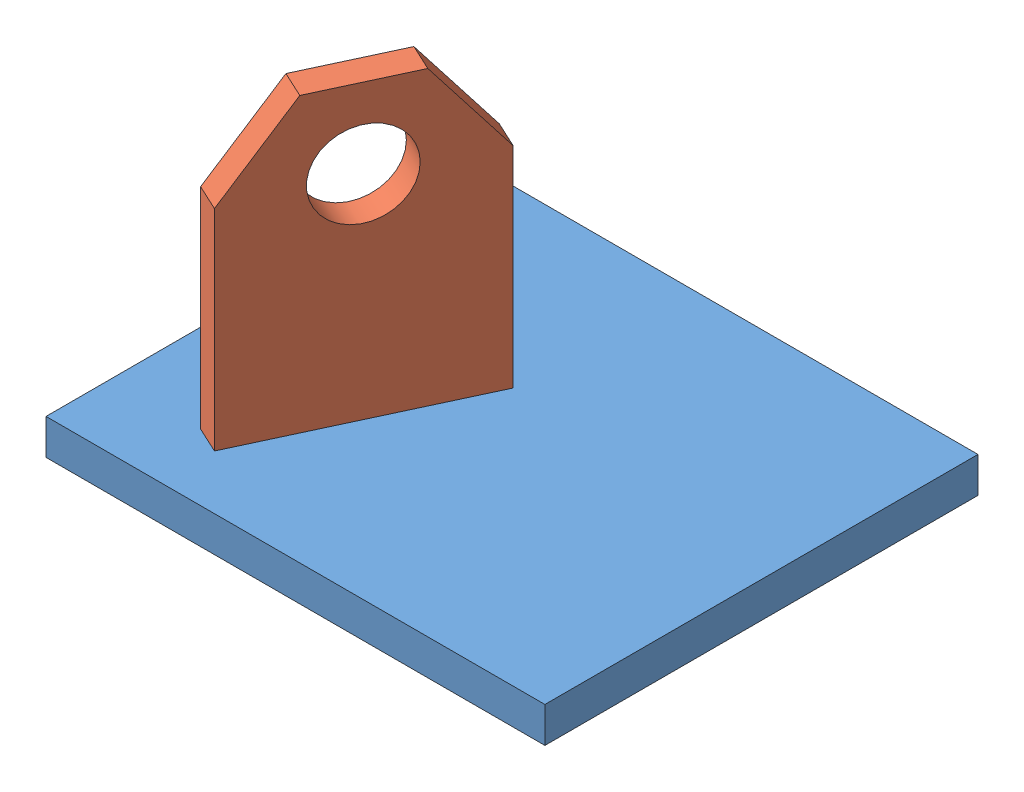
SolidWorks assembly Baugruppe1.sldasm, configuration Default (file format 3800). Lengths in mm.
Overall size (146.3 96.14 127).
2 component instances, 2 part files, 1 mates.
Components (placement in the parent):
- plate-1: plate.SLDPRT [Default] at (47.8231 -10.0771 34.4394) size (146.3 10.41 127)
- tab-1: tab.SLDPRT [Default] at (-16.6556 0.3369 -13.9067) x (0.421525 0 -0.906817) z (0.906817 0 0.421525) size (65.93 85.72 8.38)
Mates (geometry in assembly coordinates):
- Deckungsgleich1: coincident anti-aligned: plane of plate-1 through (75.9679 0.3369 -61.6778) normal (0 1 0); plane of tab-1 through (-9.0547 0.3369 -10.3735) normal (0 -1 0)
